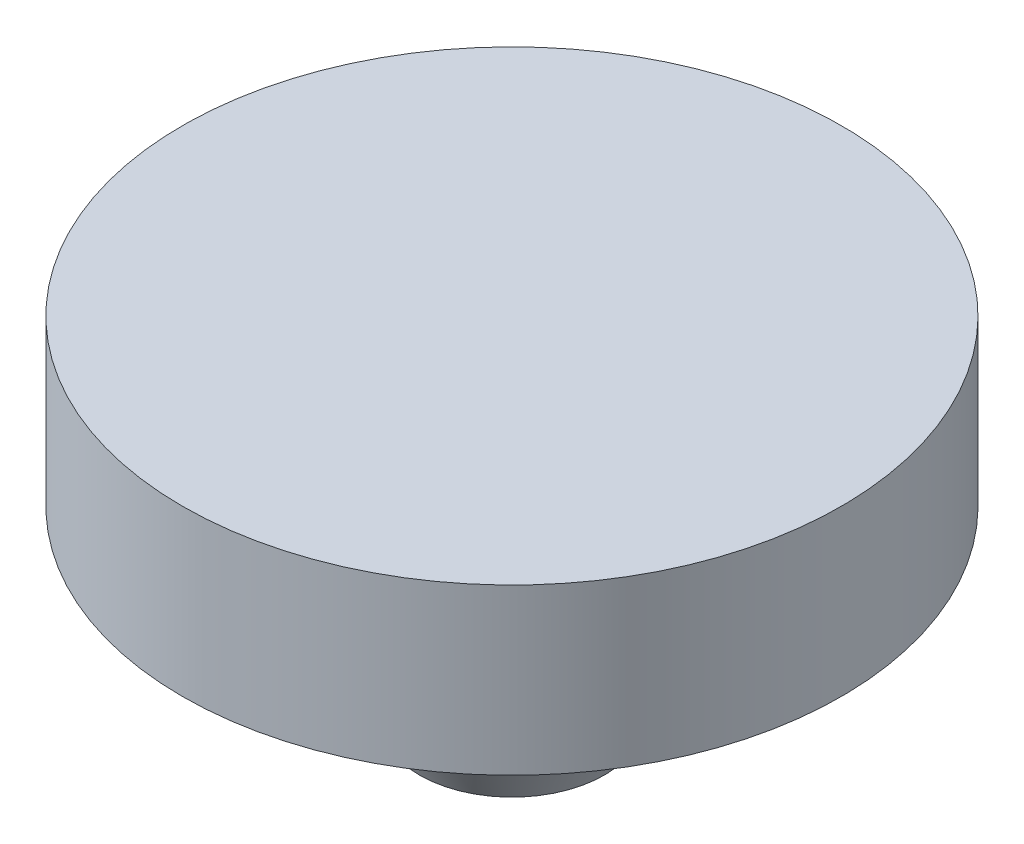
ISO-10303-21;
HEADER;
FILE_DESCRIPTION(('STEP AP214'),'2;1');
FILE_NAME('part.step','',(''),(''),'','','');
FILE_SCHEMA(('AUTOMOTIVE_DESIGN { 1 0 10303 214 1 1 1 1 }'));
ENDSEC;
DATA;
#1=APPLICATION_CONTEXT('core data for automotive mechanical design processes');
#2=APPLICATION_PROTOCOL_DEFINITION('international standard','automotive_design',2000,#1);
#3=PRODUCT_CONTEXT('',#1,'mechanical');
#4=PRODUCT('Part','Part','',(#3));
#5=PRODUCT_RELATED_PRODUCT_CATEGORY('part','',(#4));
#6=PRODUCT_DEFINITION_FORMATION('','',#4);
#7=PRODUCT_DEFINITION_CONTEXT('part definition',#1,'design');
#8=PRODUCT_DEFINITION('design','',#6,#7);
#9=PRODUCT_DEFINITION_SHAPE('','',#8);
#10=(LENGTH_UNIT() NAMED_UNIT(*) SI_UNIT(.MILLI.,.METRE.));
#11=(NAMED_UNIT(*) PLANE_ANGLE_UNIT() SI_UNIT($,.RADIAN.));
#12=(NAMED_UNIT(*) SI_UNIT($,.STERADIAN.) SOLID_ANGLE_UNIT());
#13=UNCERTAINTY_MEASURE_WITH_UNIT(LENGTH_MEASURE(1.E-05),#10,'distance_accuracy_value','');
#14=(GEOMETRIC_REPRESENTATION_CONTEXT(3) GLOBAL_UNCERTAINTY_ASSIGNED_CONTEXT((#13)) GLOBAL_UNIT_ASSIGNED_CONTEXT((#10,
#11,#12)) REPRESENTATION_CONTEXT('',''));
#15=CARTESIAN_POINT('',(0.,0.,0.));
#16=DIRECTION('',(0.,0.,1.));
#17=DIRECTION('',(1.,0.,0.));
#18=AXIS2_PLACEMENT_3D('',#15,#16,#17);
#19=CARTESIAN_POINT('',(0.,6.35,0.));
#20=DIRECTION('',(0.,-1.,0.));
#21=DIRECTION('',(0.,0.,-1.));
#22=AXIS2_PLACEMENT_3D('',#19,#20,#21);
#23=CYLINDRICAL_SURFACE('',#22,12.7);
#24=CARTESIAN_POINT('',(0.,6.35,0.));
#25=DIRECTION('',(0.,1.,0.));
#26=DIRECTION('',(0.,0.,1.));
#27=AXIS2_PLACEMENT_3D('',#24,#25,#26);
#28=CIRCLE('',#27,12.7);
#29=CARTESIAN_POINT('',(0.,6.35,12.7));
#30=VERTEX_POINT('',#29);
#31=EDGE_CURVE('E36',#30,#30,#28,.T.);
#32=ORIENTED_EDGE('',*,*,#31,.F.);
#33=EDGE_LOOP('',(#32));
#34=FACE_BOUND('',#33,.T.);
#35=CARTESIAN_POINT('',(0.,0.,0.));
#36=DIRECTION('',(0.,1.,0.));
#37=DIRECTION('',(0.,0.,1.));
#38=AXIS2_PLACEMENT_3D('',#35,#36,#37);
#39=CIRCLE('',#38,12.7);
#40=CARTESIAN_POINT('',(0.,0.,12.7));
#41=VERTEX_POINT('',#40);
#42=EDGE_CURVE('E40',#41,#41,#39,.T.);
#43=ORIENTED_EDGE('',*,*,#42,.T.);
#44=EDGE_LOOP('',(#43));
#45=FACE_BOUND('',#44,.T.);
#46=ADVANCED_FACE('F30',(#34,#45),#23,.T.);
#47=CARTESIAN_POINT('',(0.,6.35,0.));
#48=DIRECTION('',(0.,1.,0.));
#49=DIRECTION('',(0.,0.,1.));
#50=AXIS2_PLACEMENT_3D('',#47,#48,#49);
#51=PLANE('',#50);
#52=ORIENTED_EDGE('',*,*,#31,.T.);
#53=EDGE_LOOP('',(#52));
#54=FACE_BOUND('',#53,.T.);
#55=ADVANCED_FACE('F74',(#54),#51,.T.);
#56=CARTESIAN_POINT('',(0.,0.,0.));
#57=DIRECTION('',(0.,1.,0.));
#58=DIRECTION('',(0.,0.,1.));
#59=AXIS2_PLACEMENT_3D('',#56,#57,#58);
#60=PLANE('',#59);
#61=CARTESIAN_POINT('',(0.,0.,0.));
#62=DIRECTION('',(0.,1.,0.));
#63=DIRECTION('',(0.,0.,1.));
#64=AXIS2_PLACEMENT_3D('',#61,#62,#63);
#65=CIRCLE('',#64,4.7625);
#66=CARTESIAN_POINT('',(0.,0.,4.7625));
#67=VERTEX_POINT('',#66);
#68=EDGE_CURVE('E10',#67,#67,#65,.F.);
#69=ORIENTED_EDGE('',*,*,#68,.F.);
#70=EDGE_LOOP('',(#69));
#71=FACE_BOUND('',#70,.T.);
#72=ORIENTED_EDGE('',*,*,#42,.F.);
#73=EDGE_LOOP('',(#72));
#74=FACE_BOUND('',#73,.T.);
#75=ADVANCED_FACE('F79',(#71,#74),#60,.F.);
#76=CARTESIAN_POINT('',(0.,-2.286,0.));
#77=DIRECTION('',(0.,1.,0.));
#78=DIRECTION('',(0.,0.,1.));
#79=AXIS2_PLACEMENT_3D('',#76,#77,#78);
#80=CYLINDRICAL_SURFACE('',#79,4.7625);
#81=CARTESIAN_POINT('',(0.,-2.286,0.));
#82=DIRECTION('',(0.,-1.,0.));
#83=DIRECTION('',(0.,0.,-1.));
#84=AXIS2_PLACEMENT_3D('',#81,#82,#83);
#85=CIRCLE('',#84,4.7625);
#86=CARTESIAN_POINT('',(0.,-2.286,-4.7625));
#87=VERTEX_POINT('',#86);
#88=EDGE_CURVE('E45',#87,#87,#85,.T.);
#89=ORIENTED_EDGE('',*,*,#88,.F.);
#90=EDGE_LOOP('',(#89));
#91=FACE_BOUND('',#90,.T.);
#92=ORIENTED_EDGE('',*,*,#68,.T.);
#93=EDGE_LOOP('',(#92));
#94=FACE_BOUND('',#93,.T.);
#95=ADVANCED_FACE('F62',(#91,#94),#80,.T.);
#96=CARTESIAN_POINT('',(0.,-7.1882,0.));
#97=DIRECTION('',(0.,1.,0.));
#98=DIRECTION('',(0.,0.,1.));
#99=AXIS2_PLACEMENT_3D('',#96,#97,#98);
#100=CONICAL_SURFACE('',#99,3.5687,0.516071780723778);
#101=CARTESIAN_POINT('',(0.,-2.286,0.));
#102=DIRECTION('',(0.,1.,0.));
#103=DIRECTION('',(0.,0.,1.));
#104=AXIS2_PLACEMENT_3D('',#101,#102,#103);
#105=CIRCLE('',#104,6.35);
#106=CARTESIAN_POINT('',(0.,-2.286,6.35));
#107=VERTEX_POINT('',#106);
#108=EDGE_CURVE('E52',#107,#107,#105,.T.);
#109=ORIENTED_EDGE('',*,*,#108,.F.);
#110=EDGE_LOOP('',(#109));
#111=FACE_BOUND('',#110,.T.);
#112=CARTESIAN_POINT('',(0.,-7.1882,0.));
#113=DIRECTION('',(0.,1.,0.));
#114=DIRECTION('',(0.,0.,1.));
#115=AXIS2_PLACEMENT_3D('',#112,#113,#114);
#116=CIRCLE('',#115,3.5687);
#117=CARTESIAN_POINT('',(0.,-7.1882,3.5687));
#118=VERTEX_POINT('',#117);
#119=EDGE_CURVE('E49',#118,#118,#116,.T.);
#120=ORIENTED_EDGE('',*,*,#119,.T.);
#121=EDGE_LOOP('',(#120));
#122=FACE_BOUND('',#121,.T.);
#123=ADVANCED_FACE('F58',(#111,#122),#100,.T.);
#124=CARTESIAN_POINT('',(0.,-7.1882,0.));
#125=DIRECTION('',(0.,1.,0.));
#126=DIRECTION('',(0.,0.,1.));
#127=AXIS2_PLACEMENT_3D('',#124,#125,#126);
#128=PLANE('',#127);
#129=ORIENTED_EDGE('',*,*,#119,.F.);
#130=EDGE_LOOP('',(#129));
#131=FACE_BOUND('',#130,.T.);
#132=ADVANCED_FACE('F61',(#131),#128,.F.);
#133=CARTESIAN_POINT('',(0.,-2.286,0.));
#134=DIRECTION('',(0.,-1.,0.));
#135=DIRECTION('',(0.,0.,-1.));
#136=AXIS2_PLACEMENT_3D('',#133,#134,#135);
#137=PLANE('',#136);
#138=ORIENTED_EDGE('',*,*,#88,.T.);
#139=EDGE_LOOP('',(#138));
#140=FACE_BOUND('',#139,.T.);
#141=ORIENTED_EDGE('',*,*,#108,.T.);
#142=EDGE_LOOP('',(#141));
#143=FACE_BOUND('',#142,.T.);
#144=ADVANCED_FACE('F56',(#140,#143),#137,.F.);
#145=CLOSED_SHELL('',(#46,#55,#75,#95,#123,#132,#144));
#146=MANIFOLD_SOLID_BREP('B2',#145);
#147=ADVANCED_BREP_SHAPE_REPRESENTATION('',(#18,#146),#14);
#148=SHAPE_DEFINITION_REPRESENTATION(#9,#147);
ENDSEC;
END-ISO-10303-21;
